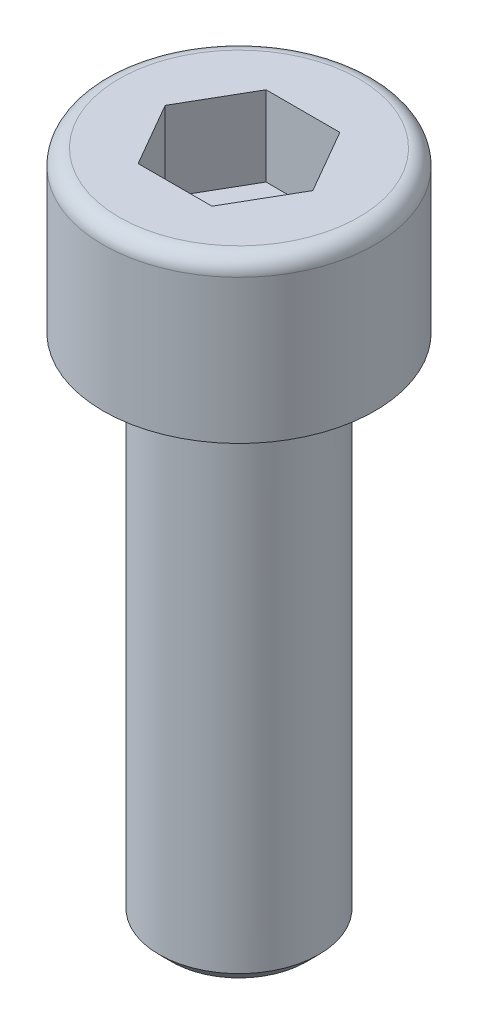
from build123d import *

# Parameters (mm, degrees)
ENL_V_MAT_EXTRU_1_DEPTH = 2.5
CHANFREIN1_SIZE         = 0.4


with BuildPart() as part:
    # Esquisse1 → Base-R_volution (revolve)
    with BuildSketch(Plane.XY, mode=Mode.PRIVATE) as base_r_volution_sk:
        with BuildLine():
            Line((0, 21), (-3.75, 21))
            ThreePointArc((-3.75, 21), (-4.103553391, 20.853553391), (-4.25, 20.5))
            Line((-4.25, 20.5), (-4.25, 16))
            Line((-4.25, 16), (-2.5, 16))
            Line((-2.5, 16), (-2.5, 0))
            Line((-2.5, 0), (0, 0))
            Line((0, 0), (0, 21))
        make_face()
    revolve(base_r_volution_sk.sketch.rotate(Axis((0, 23.809849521, 0), (0, -1, 0)), 270), axis=Axis((0, 23.809849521, 0), (0, -1, 0)))

    # Esquisse2 → Enl_v. mat.-Extru.1 (cut)
    with BuildSketch(Plane(origin=(0, 21, 0), x_dir=(-1, 0, 0), z_dir=(0, 1, 0))):
        Polygon((-1.154700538, -2), (1.154700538, -2), (2.309401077, 0), (1.154700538, 2), (-1.154700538, 2), (-2.309401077, 0), align=None)
    extrude(amount=-ENL_V_MAT_EXTRU_1_DEPTH, mode=Mode.SUBTRACT)

    # Chanfrein1
    chanfrein1_edges = [part.edges().sort_by_distance(p)[0] for p in [
        (0, 0, -2.5),
    ]]
    chamfer(chanfrein1_edges, length=CHANFREIN1_SIZE)


solid = part.part
